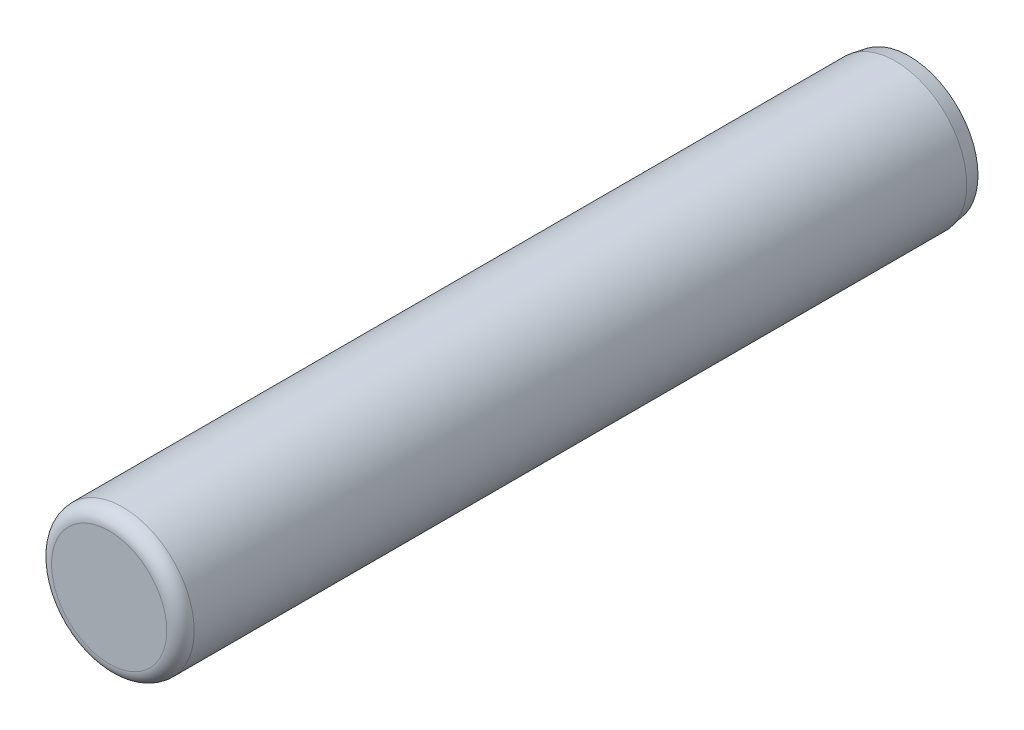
from build123d import *

# Parameters (mm, degrees)
SKETCH1_R           = 1.9812
BOSS_EXTRUDE1_DEPTH = 22.225
FILLET1_R           = 0.381
CHAMFER1_SIZE       = 0.381
CHAMFER1_SIZE2      = 0.06718058


with BuildPart() as part:
    # Sketch1 → Boss-Extrude1 (new body)
    with BuildSketch(Plane.XY):
        Circle(SKETCH1_R)
    extrude(amount=BOSS_EXTRUDE1_DEPTH)

    # Fillet1
    fillet1_edges = [part.edges().sort_by_distance(p)[0] for p in [
        (-1.9812, 0, 22.225),
    ]]
    fillet(fillet1_edges, radius=FILLET1_R)

    # Chamfer1
    chamfer1_edges = [part.edges().sort_by_distance(p)[0] for p in [
        (-1.9812, 0, 0),
    ]]
    chamfer1_side = [part.faces().sort_by_distance(p)[0] for p in [
        (-1.9812, 0, 10.922),
    ]]
    chamfer(chamfer1_edges, length=CHAMFER1_SIZE, length2=CHAMFER1_SIZE2, reference=chamfer1_side[0])


solid = part.part
